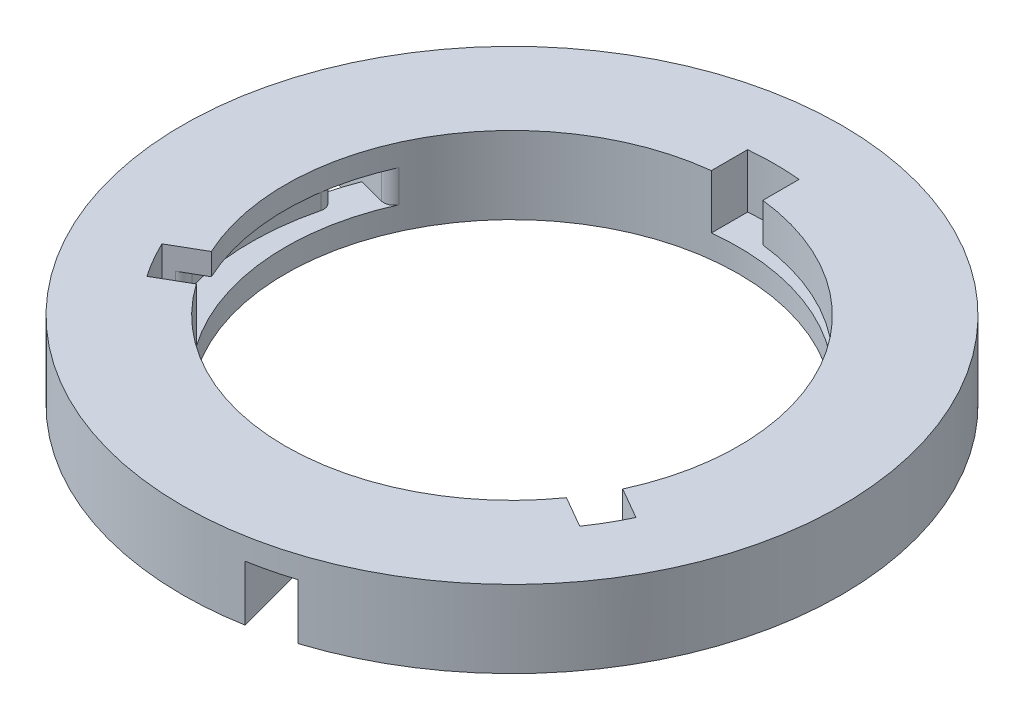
from build123d import *

# Parameters (mm, degrees)
ESQUISSE2_W                  = 20
ESQUISSE2_H                  = 15
ENL_V_START                  = -10.5
ENL_V_MAT_EXTRU_1_DEPTH      = 10.5
ENL_V_MAT_EXTRU_2_DEPTH      = 10.5
R_P_TITION_CIRCULAIRE1_COUNT = 2
R_P_TITION_CIRCULAIRE1_ANGLE = 120
ENL_V_MAT_EXTRU_5_DEPTH      = 3
ENL_V_MAT_EXTRU_7_DEPTH      = 3
ENL_V_MAT_EXTRU_8_DEPTH      = 3.25
ENL_V_MAT_EXTRU_9_DEPTH      = 3.25
R_P_TITION_CIRCULAIRE3_COUNT = 2
R_P_TITION_CIRCULAIRE3_ANGLE = 120
CONG_1_R                     = 2
ENL_V_MAT_EXTRU_10_REACH     = 93.146
R_P_TITION_CIRCULAIRE4_COUNT = 2
R_P_TITION_CIRCULAIRE4_ANGLE = 120


with BuildPart() as part:
    # Esquisse2 → R_volution3 (revolve)
    with BuildSketch(Plane.XY, mode=Mode.PRIVATE) as r_volution3_sk:
        with Locations((54, 7.5)):
            Rectangle(ESQUISSE2_W, ESQUISSE2_H)
    revolve(r_volution3_sk.sketch.rotate(Axis((0, 40.307612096, 0), (0, -1, 0)), 90), axis=Axis((0, 40.307612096, 0), (0, -1, 0)))

    # Esquisse4 → Enl_v. mat.-Extru.1 (cut)
    with BuildSketch(Plane(origin=(0, 15, 0), x_dir=(1, 0, 0), z_dir=(0, 1, 0)).offset(ENL_V_START)):
        with BuildLine():
            Line((5, 50.754310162), (5, 43.714985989))
            ThreePointArc((5, 43.714985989), (0, 44), (-5, 43.714985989))
            Line((-5, 43.714985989), (-5, 50.754310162))
            ThreePointArc((-5, 50.754310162), (0, 51), (5, 50.754310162))
        make_face()
    extrude(amount=ENL_V_MAT_EXTRU_1_DEPTH, mode=Mode.SUBTRACT)

    # Esquisse5 → Enl_v. mat.-Extru.2 (cut)
    with BuildSketch(Plane(origin=(0, 15, 0), x_dir=(1, 0, 0), z_dir=(0, 1, 0)).offset(ENL_V_START)):
        with BuildLine():
            Line((-46.031238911, -21.957346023), (-39.947331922, -18.444800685))
            ThreePointArc((-39.947331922, -18.444800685), (-38.105117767, -22), (-35.947331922, -25.373003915))
            Line((-35.947331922, -25.373003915), (-42.031238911, -28.885549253))
            ThreePointArc((-42.031238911, -28.885549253), (-44.167295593, -25.5), (-46.031238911, -21.957346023))
        make_face()
    enl_v_mat_extru_2 = extrude(amount=ENL_V_MAT_EXTRU_2_DEPTH, mode=Mode.SUBTRACT)

    # R_p_tition circulaire1: Enl_v. mat.-Extru.2 ×2 about axis
    r_p_tition_circulaire1_axis = Axis((0, 0, 0), (0, 1, 0))
    for i in range(1, R_P_TITION_CIRCULAIRE1_COUNT):
        add(enl_v_mat_extru_2.rotate(r_p_tition_circulaire1_axis, i * R_P_TITION_CIRCULAIRE1_ANGLE / (R_P_TITION_CIRCULAIRE1_COUNT - 1)), mode=Mode.SUBTRACT)

    # Esquisse13 → Enl_v. mat.-Extru.5 (cut)
    with BuildSketch(Plane(origin=(0, 4.5, 0), x_dir=(1, 0, 0), z_dir=(0, 1, 0))):
        with BuildLine():
            Line((36.250971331, 24.937262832), (41.272861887, 29.959153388))
            ThreePointArc((41.272861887, 29.959153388), (25.365410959, 44.244727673), (5, 50.754310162))
            Line((5, 50.754310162), (5, 43.714985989))
            ThreePointArc((5, 43.714985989), (22.661892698, 37.715230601), (36.250971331, 24.937262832))
        make_face()
    extrude(amount=ENL_V_MAT_EXTRU_5_DEPTH, mode=Mode.SUBTRACT)

    # Esquisse18 → Enl_v. mat.-Extru.7 (cut)
    with BuildSketch(Plane(origin=(0, 4.5, 0), x_dir=(1, 0, 0), z_dir=(0, 1, 0))):
        with BuildLine():
            Line((5.986126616, -43.590896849), (7.810197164, -50.398420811))
            ThreePointArc((7.810197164, -50.398420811), (27.143011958, -43.177041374), (42.031238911, -28.885549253))
            Line((42.031238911, -28.885549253), (35.947331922, -25.373003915))
            ThreePointArc((35.947331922, -25.373003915), (22.859935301, -37.595523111), (5.986126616, -43.590896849))
        make_face()
    enl_v_mat_extru_7 = extrude(amount=ENL_V_MAT_EXTRU_7_DEPTH, mode=Mode.SUBTRACT)

    # Esquisse20 → Enl_v. mat.-Extru.8 (cut)
    with BuildSketch(Plane(origin=(0, 7.5, 0), x_dir=(1, 0, 0), z_dir=(0, 1, 0))):
        with BuildLine():
            Line((38.978420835, -27.123003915), (35.947331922, -25.373003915))
            ThreePointArc((35.947331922, -25.373003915), (26.385824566, -35.210627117), (14.259314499, -41.625376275))
            ThreePointArc((14.259314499, -41.625376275), (27.680195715, -36.183210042), (38.978420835, -27.123003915))
        make_face()
    enl_v_mat_extru_8 = extrude(amount=ENL_V_MAT_EXTRU_8_DEPTH, mode=Mode.SUBTRACT)

    # Esquisse21 → Enl_v. mat.-Extru.9 (cut)
    with BuildSketch(Plane.XZ.offset(-7.5)):
        with BuildLine():
            Line((5.986126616, 43.590896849), (7.810197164, 50.398420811))
            ThreePointArc((7.810197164, 50.398420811), (11.984154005, 49.571968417), (16.074692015, 48.400457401))
            Line((16.074692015, 48.400457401), (14.259314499, 41.625376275))
            ThreePointArc((14.259314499, 41.625376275), (10.170314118, 42.80846541), (5.986126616, 43.590896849))
        make_face()
    enl_v_mat_extru_9 = extrude(amount=-ENL_V_MAT_EXTRU_9_DEPTH, mode=Mode.SUBTRACT)

    # R_p_tition circulaire3: Enl_v. mat.-Extru.7, Enl_v. mat.-Extru.8, Enl_v. mat.-Extru.9 ×2 about axis
    r_p_tition_circulaire3_axis = Axis((0, 0, 0), (0, -1, 0))
    add([enl_v_mat_extru_7.rotate(r_p_tition_circulaire3_axis, i * R_P_TITION_CIRCULAIRE3_ANGLE / (R_P_TITION_CIRCULAIRE3_COUNT - 1)) for i in range(1, R_P_TITION_CIRCULAIRE3_COUNT)], mode=Mode.SUBTRACT)
    add([enl_v_mat_extru_8.rotate(r_p_tition_circulaire3_axis, i * R_P_TITION_CIRCULAIRE3_ANGLE / (R_P_TITION_CIRCULAIRE3_COUNT - 1)) for i in range(1, R_P_TITION_CIRCULAIRE3_COUNT)], mode=Mode.SUBTRACT)
    add([enl_v_mat_extru_9.rotate(r_p_tition_circulaire3_axis, i * R_P_TITION_CIRCULAIRE3_ANGLE / (R_P_TITION_CIRCULAIRE3_COUNT - 1)) for i in range(1, R_P_TITION_CIRCULAIRE3_COUNT)], mode=Mode.SUBTRACT)

    # Cong_1
    cong_1_edges = [part.edges().sort_by_distance(p)[0] for p in [
        (-40.743887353, 7.625, -16.611310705),
        (-43.178290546, 9.125, -8.463759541),
        (-42.978420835, 9.125, 20.194800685),
        (5.986126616, 7.625, 43.590896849),
        (14.259314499, 9.125, 41.625376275),
        (38.978420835, 9.125, 27.123003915),
    ]]
    fillet(cong_1_edges, radius=CONG_1_R)

    # Esquisse23 → Enl_v. mat.-Extru.10 (cut, up to next)
    with BuildSketch(Plane.XZ.offset(-10.75), mode=Mode.PRIVATE) as enl_v_mat_extru_10_sk1:
        with BuildLine():
            Line((7.810197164, 50.398420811), (11.190547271, 63.01405916))
            ThreePointArc((11.190547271, 63.01405916), (15.351165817, 62.1316482), (19.443988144, 60.974841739))
            Line((19.443988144, 60.974841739), (16.074692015, 48.400457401))
            ThreePointArc((16.074692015, 48.400457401), (11.984154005, 49.571968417), (7.810197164, 50.398420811))
        make_face()
    enl_v_mat_extru_10_tool1 = extrude(enl_v_mat_extru_10_sk1.sketch, amount=ENL_V_MAT_EXTRU_10_REACH, mode=Mode.PRIVATE) & part.part
    enl_v_mat_extru_10 = enl_v_mat_extru_10_tool1.solids().sort_by_distance((13.655116, 10.75, 55.800166))[0]
    add(enl_v_mat_extru_10, mode=Mode.SUBTRACT)

    # R_p_tition circulaire4: Enl_v. mat.-Extru.10 ×2 about axis
    r_p_tition_circulaire4_axis = Axis((0, 40.307612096, 0), (0, -1, 0))
    for i in range(1, R_P_TITION_CIRCULAIRE4_COUNT):
        add(enl_v_mat_extru_10.rotate(r_p_tition_circulaire4_axis, i * R_P_TITION_CIRCULAIRE4_ANGLE / (R_P_TITION_CIRCULAIRE4_COUNT - 1)), mode=Mode.SUBTRACT)


solid = part.part
